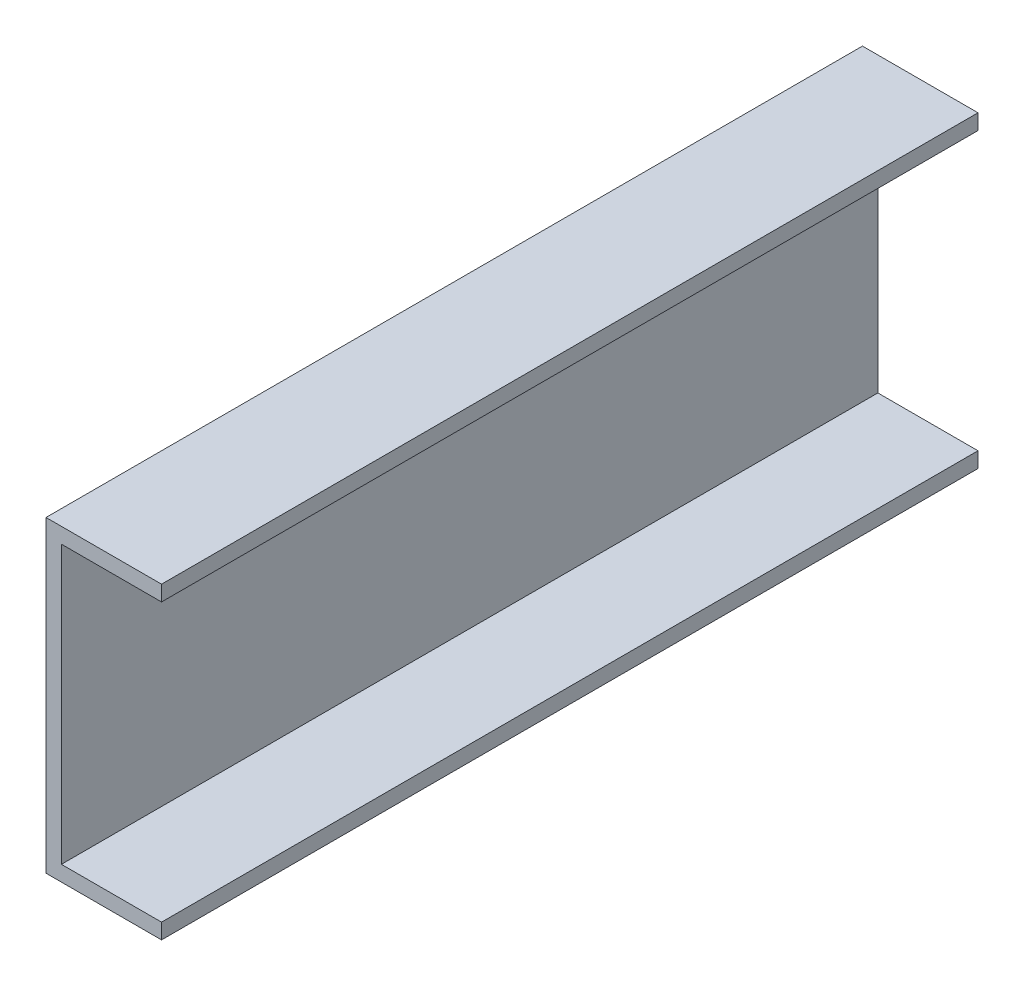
ISO-10303-21;
HEADER;
FILE_DESCRIPTION(('STEP AP214'),'2;1');
FILE_NAME('part.step','',(''),(''),'','','');
FILE_SCHEMA(('AUTOMOTIVE_DESIGN { 1 0 10303 214 1 1 1 1 }'));
ENDSEC;
DATA;
#1=APPLICATION_CONTEXT('core data for automotive mechanical design processes');
#2=APPLICATION_PROTOCOL_DEFINITION('international standard','automotive_design',2000,#1);
#3=PRODUCT_CONTEXT('',#1,'mechanical');
#4=PRODUCT('Part','Part','',(#3));
#5=PRODUCT_RELATED_PRODUCT_CATEGORY('part','',(#4));
#6=PRODUCT_DEFINITION_FORMATION('','',#4);
#7=PRODUCT_DEFINITION_CONTEXT('part definition',#1,'design');
#8=PRODUCT_DEFINITION('design','',#6,#7);
#9=PRODUCT_DEFINITION_SHAPE('','',#8);
#10=(LENGTH_UNIT() NAMED_UNIT(*) SI_UNIT(.MILLI.,.METRE.));
#11=(NAMED_UNIT(*) PLANE_ANGLE_UNIT() SI_UNIT($,.RADIAN.));
#12=(NAMED_UNIT(*) SI_UNIT($,.STERADIAN.) SOLID_ANGLE_UNIT());
#13=UNCERTAINTY_MEASURE_WITH_UNIT(LENGTH_MEASURE(1.E-05),#10,'distance_accuracy_value','');
#14=(GEOMETRIC_REPRESENTATION_CONTEXT(3) GLOBAL_UNCERTAINTY_ASSIGNED_CONTEXT((#13)) GLOBAL_UNIT_ASSIGNED_CONTEXT((#10,
#11,#12)) REPRESENTATION_CONTEXT('',''));
#15=CARTESIAN_POINT('',(0.,0.,0.));
#16=DIRECTION('',(0.,0.,1.));
#17=DIRECTION('',(1.,0.,0.));
#18=AXIS2_PLACEMENT_3D('',#15,#16,#17);
#19=CARTESIAN_POINT('',(75.,10.,265.));
#20=DIRECTION('',(-1.,0.,0.));
#21=DIRECTION('',(0.,0.,1.));
#22=AXIS2_PLACEMENT_3D('',#19,#20,#21);
#23=PLANE('',#22);
#24=DIRECTION('',(0.,1.,0.));
#25=VECTOR('',#24,1.);
#26=CARTESIAN_POINT('',(75.,10.,-265.));
#27=LINE('',#26,#25);
#28=CARTESIAN_POINT('',(75.,0.,-265.));
#29=VERTEX_POINT('',#28);
#30=CARTESIAN_POINT('',(75.,10.,-265.));
#31=VERTEX_POINT('',#30);
#32=EDGE_CURVE('E129',#29,#31,#27,.T.);
#33=ORIENTED_EDGE('',*,*,#32,.T.);
#34=DIRECTION('',(0.,0.,-1.));
#35=VECTOR('',#34,1.);
#36=CARTESIAN_POINT('',(75.,10.,265.));
#37=LINE('',#36,#35);
#38=CARTESIAN_POINT('',(75.,10.,265.));
#39=VERTEX_POINT('',#38);
#40=EDGE_CURVE('E11',#39,#31,#37,.T.);
#41=ORIENTED_EDGE('',*,*,#40,.F.);
#42=DIRECTION('',(0.,1.,0.));
#43=VECTOR('',#42,1.);
#44=CARTESIAN_POINT('',(75.,10.,265.));
#45=LINE('',#44,#43);
#46=CARTESIAN_POINT('',(75.,0.,265.));
#47=VERTEX_POINT('',#46);
#48=EDGE_CURVE('E143',#47,#39,#45,.T.);
#49=ORIENTED_EDGE('',*,*,#48,.F.);
#50=DIRECTION('',(0.,0.,-1.));
#51=VECTOR('',#50,1.);
#52=CARTESIAN_POINT('',(75.,0.,265.));
#53=LINE('',#52,#51);
#54=EDGE_CURVE('E125',#47,#29,#53,.T.);
#55=ORIENTED_EDGE('',*,*,#54,.T.);
#56=EDGE_LOOP('',(#33,#41,#49,#55));
#57=FACE_BOUND('',#56,.T.);
#58=ADVANCED_FACE('F33',(#57),#23,.F.);
#59=CARTESIAN_POINT('',(10.,10.,265.));
#60=DIRECTION('',(0.,-1.,0.));
#61=DIRECTION('',(0.,0.,-1.));
#62=AXIS2_PLACEMENT_3D('',#59,#60,#61);
#63=PLANE('',#62);
#64=DIRECTION('',(-1.,0.,0.));
#65=VECTOR('',#64,1.);
#66=CARTESIAN_POINT('',(10.,10.,-265.));
#67=LINE('',#66,#65);
#68=CARTESIAN_POINT('',(10.,10.,-265.));
#69=VERTEX_POINT('',#68);
#70=EDGE_CURVE('E132',#31,#69,#67,.T.);
#71=ORIENTED_EDGE('',*,*,#70,.T.);
#72=DIRECTION('',(0.,0.,-1.));
#73=VECTOR('',#72,1.);
#74=CARTESIAN_POINT('',(10.,10.,265.));
#75=LINE('',#74,#73);
#76=CARTESIAN_POINT('',(10.,10.,265.));
#77=VERTEX_POINT('',#76);
#78=EDGE_CURVE('E41',#77,#69,#75,.T.);
#79=ORIENTED_EDGE('',*,*,#78,.F.);
#80=DIRECTION('',(-1.,0.,0.));
#81=VECTOR('',#80,1.);
#82=CARTESIAN_POINT('',(10.,10.,265.));
#83=LINE('',#82,#81);
#84=EDGE_CURVE('E92',#39,#77,#83,.T.);
#85=ORIENTED_EDGE('',*,*,#84,.F.);
#86=ORIENTED_EDGE('',*,*,#40,.T.);
#87=EDGE_LOOP('',(#71,#79,#85,#86));
#88=FACE_BOUND('',#87,.T.);
#89=ADVANCED_FACE('F178',(#88),#63,.F.);
#90=CARTESIAN_POINT('',(9.99999999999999,190.,265.));
#91=DIRECTION('',(-1.,0.,0.));
#92=DIRECTION('',(0.,-1.,0.));
#93=AXIS2_PLACEMENT_3D('',#90,#91,#92);
#94=PLANE('',#93);
#95=DIRECTION('',(0.,1.,0.));
#96=VECTOR('',#95,1.);
#97=CARTESIAN_POINT('',(9.99999999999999,190.,-265.));
#98=LINE('',#97,#96);
#99=CARTESIAN_POINT('',(9.99999999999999,190.,-265.));
#100=VERTEX_POINT('',#99);
#101=EDGE_CURVE('E134',#69,#100,#98,.T.);
#102=ORIENTED_EDGE('',*,*,#101,.T.);
#103=DIRECTION('',(0.,0.,-1.));
#104=VECTOR('',#103,1.);
#105=CARTESIAN_POINT('',(9.99999999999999,190.,265.));
#106=LINE('',#105,#104);
#107=CARTESIAN_POINT('',(9.99999999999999,190.,265.));
#108=VERTEX_POINT('',#107);
#109=EDGE_CURVE('E150',#108,#100,#106,.T.);
#110=ORIENTED_EDGE('',*,*,#109,.F.);
#111=DIRECTION('',(0.,1.,0.));
#112=VECTOR('',#111,1.);
#113=CARTESIAN_POINT('',(9.99999999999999,190.,265.));
#114=LINE('',#113,#112);
#115=EDGE_CURVE('E158',#77,#108,#114,.T.);
#116=ORIENTED_EDGE('',*,*,#115,.F.);
#117=ORIENTED_EDGE('',*,*,#78,.T.);
#118=EDGE_LOOP('',(#102,#110,#116,#117));
#119=FACE_BOUND('',#118,.T.);
#120=ADVANCED_FACE('F156',(#119),#94,.F.);
#121=CARTESIAN_POINT('',(75.,190.,265.));
#122=DIRECTION('',(0.,1.,0.));
#123=DIRECTION('',(0.,0.,1.));
#124=AXIS2_PLACEMENT_3D('',#121,#122,#123);
#125=PLANE('',#124);
#126=DIRECTION('',(1.,0.,0.));
#127=VECTOR('',#126,1.);
#128=CARTESIAN_POINT('',(75.,190.,-265.));
#129=LINE('',#128,#127);
#130=CARTESIAN_POINT('',(75.,190.,-265.));
#131=VERTEX_POINT('',#130);
#132=EDGE_CURVE('E136',#100,#131,#129,.T.);
#133=ORIENTED_EDGE('',*,*,#132,.T.);
#134=DIRECTION('',(0.,0.,-1.));
#135=VECTOR('',#134,1.);
#136=CARTESIAN_POINT('',(75.,190.,265.));
#137=LINE('',#136,#135);
#138=CARTESIAN_POINT('',(75.,190.,265.));
#139=VERTEX_POINT('',#138);
#140=EDGE_CURVE('E147',#139,#131,#137,.T.);
#141=ORIENTED_EDGE('',*,*,#140,.F.);
#142=DIRECTION('',(1.,0.,0.));
#143=VECTOR('',#142,1.);
#144=CARTESIAN_POINT('',(75.,190.,265.));
#145=LINE('',#144,#143);
#146=EDGE_CURVE('E170',#108,#139,#145,.T.);
#147=ORIENTED_EDGE('',*,*,#146,.F.);
#148=ORIENTED_EDGE('',*,*,#109,.T.);
#149=EDGE_LOOP('',(#133,#141,#147,#148));
#150=FACE_BOUND('',#149,.T.);
#151=ADVANCED_FACE('F166',(#150),#125,.F.);
#152=CARTESIAN_POINT('',(75.,200.,265.));
#153=DIRECTION('',(-1.,0.,0.));
#154=DIRECTION('',(0.,-1.,0.));
#155=AXIS2_PLACEMENT_3D('',#152,#153,#154);
#156=PLANE('',#155);
#157=DIRECTION('',(0.,1.,0.));
#158=VECTOR('',#157,1.);
#159=CARTESIAN_POINT('',(75.,200.,-265.));
#160=LINE('',#159,#158);
#161=CARTESIAN_POINT('',(75.,200.,-265.));
#162=VERTEX_POINT('',#161);
#163=EDGE_CURVE('E138',#131,#162,#160,.T.);
#164=ORIENTED_EDGE('',*,*,#163,.T.);
#165=DIRECTION('',(0.,0.,-1.));
#166=VECTOR('',#165,1.);
#167=CARTESIAN_POINT('',(75.,200.,265.));
#168=LINE('',#167,#166);
#169=CARTESIAN_POINT('',(75.,200.,265.));
#170=VERTEX_POINT('',#169);
#171=EDGE_CURVE('E120',#170,#162,#168,.T.);
#172=ORIENTED_EDGE('',*,*,#171,.F.);
#173=DIRECTION('',(0.,1.,0.));
#174=VECTOR('',#173,1.);
#175=CARTESIAN_POINT('',(75.,200.,265.));
#176=LINE('',#175,#174);
#177=EDGE_CURVE('E111',#139,#170,#176,.T.);
#178=ORIENTED_EDGE('',*,*,#177,.F.);
#179=ORIENTED_EDGE('',*,*,#140,.T.);
#180=EDGE_LOOP('',(#164,#172,#178,#179));
#181=FACE_BOUND('',#180,.T.);
#182=ADVANCED_FACE('F169',(#181),#156,.F.);
#183=CARTESIAN_POINT('',(0.,200.,265.));
#184=DIRECTION('',(0.,-1.,0.));
#185=DIRECTION('',(0.,0.,-1.));
#186=AXIS2_PLACEMENT_3D('',#183,#184,#185);
#187=PLANE('',#186);
#188=DIRECTION('',(-1.,0.,0.));
#189=VECTOR('',#188,1.);
#190=CARTESIAN_POINT('',(0.,200.,-265.));
#191=LINE('',#190,#189);
#192=CARTESIAN_POINT('',(0.,200.,-265.));
#193=VERTEX_POINT('',#192);
#194=EDGE_CURVE('E119',#162,#193,#191,.T.);
#195=ORIENTED_EDGE('',*,*,#194,.T.);
#196=DIRECTION('',(0.,0.,-1.));
#197=VECTOR('',#196,1.);
#198=CARTESIAN_POINT('',(0.,200.,265.));
#199=LINE('',#198,#197);
#200=CARTESIAN_POINT('',(0.,200.,265.));
#201=VERTEX_POINT('',#200);
#202=EDGE_CURVE('E116',#201,#193,#199,.T.);
#203=ORIENTED_EDGE('',*,*,#202,.F.);
#204=DIRECTION('',(-1.,0.,0.));
#205=VECTOR('',#204,1.);
#206=CARTESIAN_POINT('',(0.,200.,265.));
#207=LINE('',#206,#205);
#208=EDGE_CURVE('E105',#170,#201,#207,.T.);
#209=ORIENTED_EDGE('',*,*,#208,.F.);
#210=ORIENTED_EDGE('',*,*,#171,.T.);
#211=EDGE_LOOP('',(#195,#203,#209,#210));
#212=FACE_BOUND('',#211,.T.);
#213=ADVANCED_FACE('F117',(#212),#187,.F.);
#214=CARTESIAN_POINT('',(0.,0.,265.));
#215=DIRECTION('',(1.,0.,0.));
#216=DIRECTION('',(0.,0.,-1.));
#217=AXIS2_PLACEMENT_3D('',#214,#215,#216);
#218=PLANE('',#217);
#219=DIRECTION('',(0.,-1.,0.));
#220=VECTOR('',#219,1.);
#221=CARTESIAN_POINT('',(0.,0.,-265.));
#222=LINE('',#221,#220);
#223=CARTESIAN_POINT('',(0.,0.,-265.));
#224=VERTEX_POINT('',#223);
#225=EDGE_CURVE('E78',#193,#224,#222,.T.);
#226=ORIENTED_EDGE('',*,*,#225,.T.);
#227=DIRECTION('',(0.,0.,-1.));
#228=VECTOR('',#227,1.);
#229=CARTESIAN_POINT('',(0.,0.,265.));
#230=LINE('',#229,#228);
#231=CARTESIAN_POINT('',(0.,0.,265.));
#232=VERTEX_POINT('',#231);
#233=EDGE_CURVE('E121',#232,#224,#230,.T.);
#234=ORIENTED_EDGE('',*,*,#233,.F.);
#235=DIRECTION('',(0.,-1.,0.));
#236=VECTOR('',#235,1.);
#237=CARTESIAN_POINT('',(0.,0.,265.));
#238=LINE('',#237,#236);
#239=EDGE_CURVE('E109',#201,#232,#238,.T.);
#240=ORIENTED_EDGE('',*,*,#239,.F.);
#241=ORIENTED_EDGE('',*,*,#202,.T.);
#242=EDGE_LOOP('',(#226,#234,#240,#241));
#243=FACE_BOUND('',#242,.T.);
#244=ADVANCED_FACE('F123',(#243),#218,.F.);
#245=CARTESIAN_POINT('',(75.,0.,265.));
#246=DIRECTION('',(0.,1.,0.));
#247=DIRECTION('',(-1.,0.,0.));
#248=AXIS2_PLACEMENT_3D('',#245,#246,#247);
#249=PLANE('',#248);
#250=DIRECTION('',(1.,0.,0.));
#251=VECTOR('',#250,1.);
#252=CARTESIAN_POINT('',(75.,0.,-265.));
#253=LINE('',#252,#251);
#254=EDGE_CURVE('E84',#224,#29,#253,.T.);
#255=ORIENTED_EDGE('',*,*,#254,.T.);
#256=ORIENTED_EDGE('',*,*,#54,.F.);
#257=DIRECTION('',(1.,0.,0.));
#258=VECTOR('',#257,1.);
#259=CARTESIAN_POINT('',(75.,0.,265.));
#260=LINE('',#259,#258);
#261=EDGE_CURVE('E49',#232,#47,#260,.T.);
#262=ORIENTED_EDGE('',*,*,#261,.F.);
#263=ORIENTED_EDGE('',*,*,#233,.T.);
#264=EDGE_LOOP('',(#255,#256,#262,#263));
#265=FACE_BOUND('',#264,.T.);
#266=ADVANCED_FACE('F194',(#265),#249,.F.);
#267=CARTESIAN_POINT('',(0.,0.,265.));
#268=DIRECTION('',(0.,0.,-1.));
#269=DIRECTION('',(-1.,0.,0.));
#270=AXIS2_PLACEMENT_3D('',#267,#268,#269);
#271=PLANE('',#270);
#272=ORIENTED_EDGE('',*,*,#48,.T.);
#273=ORIENTED_EDGE('',*,*,#84,.T.);
#274=ORIENTED_EDGE('',*,*,#115,.T.);
#275=ORIENTED_EDGE('',*,*,#146,.T.);
#276=ORIENTED_EDGE('',*,*,#177,.T.);
#277=ORIENTED_EDGE('',*,*,#208,.T.);
#278=ORIENTED_EDGE('',*,*,#239,.T.);
#279=ORIENTED_EDGE('',*,*,#261,.T.);
#280=EDGE_LOOP('',(#272,#273,#274,#275,#276,#277,#278,#279));
#281=FACE_BOUND('',#280,.T.);
#282=ADVANCED_FACE('F107',(#281),#271,.F.);
#283=CARTESIAN_POINT('',(0.,0.,-265.));
#284=DIRECTION('',(0.,0.,-1.));
#285=DIRECTION('',(-1.,0.,0.));
#286=AXIS2_PLACEMENT_3D('',#283,#284,#285);
#287=PLANE('',#286);
#288=ORIENTED_EDGE('',*,*,#32,.F.);
#289=ORIENTED_EDGE('',*,*,#254,.F.);
#290=ORIENTED_EDGE('',*,*,#225,.F.);
#291=ORIENTED_EDGE('',*,*,#194,.F.);
#292=ORIENTED_EDGE('',*,*,#163,.F.);
#293=ORIENTED_EDGE('',*,*,#132,.F.);
#294=ORIENTED_EDGE('',*,*,#101,.F.);
#295=ORIENTED_EDGE('',*,*,#70,.F.);
#296=EDGE_LOOP('',(#288,#289,#290,#291,#292,#293,#294,#295));
#297=FACE_BOUND('',#296,.T.);
#298=ADVANCED_FACE('F162',(#297),#287,.T.);
#299=CLOSED_SHELL('',(#58,#89,#120,#151,#182,#213,#244,#266,#282,#298));
#300=MANIFOLD_SOLID_BREP('B2',#299);
#301=ADVANCED_BREP_SHAPE_REPRESENTATION('',(#18,#300),#14);
#302=SHAPE_DEFINITION_REPRESENTATION(#9,#301);
ENDSEC;
END-ISO-10303-21;
